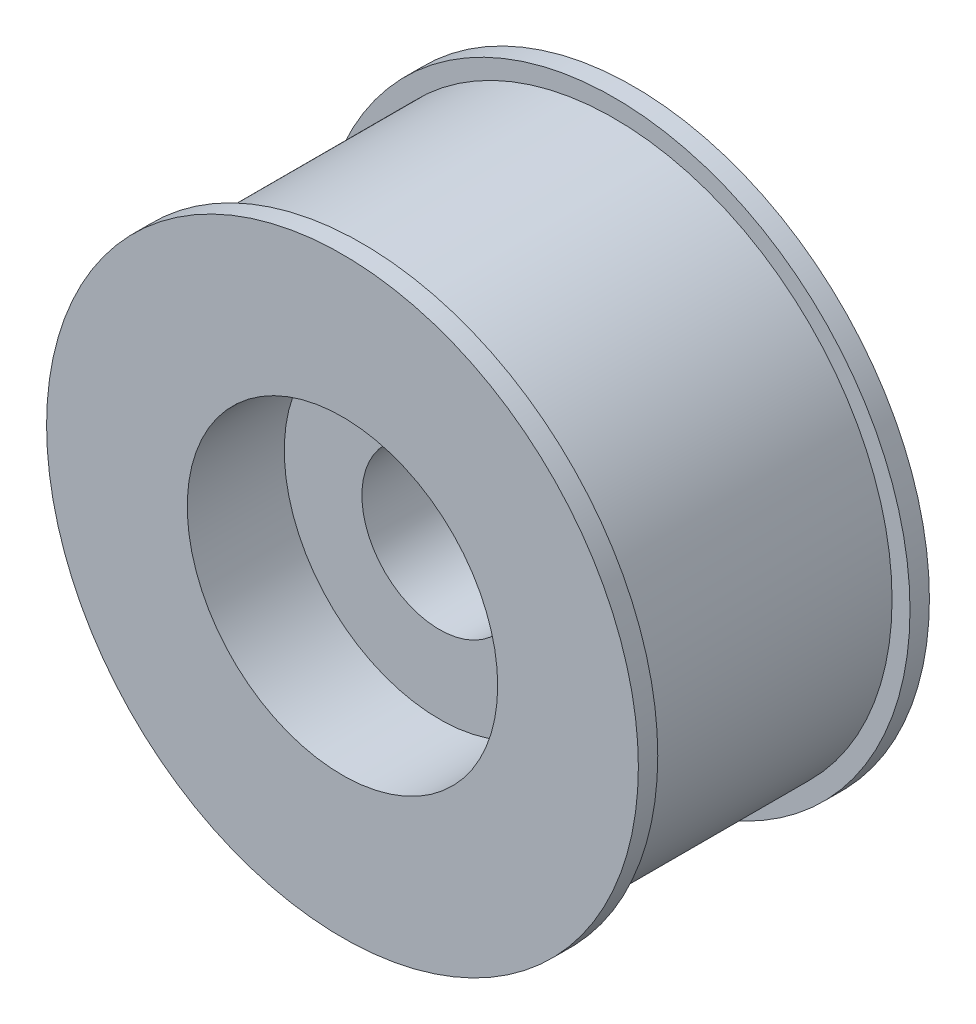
ISO-10303-21;
HEADER;
FILE_DESCRIPTION(('STEP AP214'),'2;1');
FILE_NAME('part.step','',(''),(''),'','','');
FILE_SCHEMA(('AUTOMOTIVE_DESIGN { 1 0 10303 214 1 1 1 1 }'));
ENDSEC;
DATA;
#1=APPLICATION_CONTEXT('core data for automotive mechanical design processes');
#2=APPLICATION_PROTOCOL_DEFINITION('international standard','automotive_design',2000,#1);
#3=PRODUCT_CONTEXT('',#1,'mechanical');
#4=PRODUCT('Part','Part','',(#3));
#5=PRODUCT_RELATED_PRODUCT_CATEGORY('part','',(#4));
#6=PRODUCT_DEFINITION_FORMATION('','',#4);
#7=PRODUCT_DEFINITION_CONTEXT('part definition',#1,'design');
#8=PRODUCT_DEFINITION('design','',#6,#7);
#9=PRODUCT_DEFINITION_SHAPE('','',#8);
#10=(LENGTH_UNIT() NAMED_UNIT(*) SI_UNIT(.MILLI.,.METRE.));
#11=(NAMED_UNIT(*) PLANE_ANGLE_UNIT() SI_UNIT($,.RADIAN.));
#12=(NAMED_UNIT(*) SI_UNIT($,.STERADIAN.) SOLID_ANGLE_UNIT());
#13=UNCERTAINTY_MEASURE_WITH_UNIT(LENGTH_MEASURE(1.E-05),#10,'distance_accuracy_value','');
#14=(GEOMETRIC_REPRESENTATION_CONTEXT(3) GLOBAL_UNCERTAINTY_ASSIGNED_CONTEXT((#13)) GLOBAL_UNIT_ASSIGNED_CONTEXT((#10,
#11,#12)) REPRESENTATION_CONTEXT('',''));
#15=CARTESIAN_POINT('',(0.,0.,0.));
#16=DIRECTION('',(0.,0.,1.));
#17=DIRECTION('',(1.,0.,0.));
#18=AXIS2_PLACEMENT_3D('',#15,#16,#17);
#19=CARTESIAN_POINT('',(0.,0.,0.));
#20=DIRECTION('',(0.,0.,-1.));
#21=DIRECTION('',(-1.,0.,0.));
#22=AXIS2_PLACEMENT_3D('',#19,#20,#21);
#23=PLANE('',#22);
#24=CARTESIAN_POINT('',(0.,0.,0.));
#25=DIRECTION('',(0.,0.,1.));
#26=DIRECTION('',(1.,0.,0.));
#27=AXIS2_PLACEMENT_3D('',#24,#25,#26);
#28=CIRCLE('',#27,16.);
#29=CARTESIAN_POINT('',(16.,0.,0.));
#30=VERTEX_POINT('',#29);
#31=EDGE_CURVE('E84',#30,#30,#28,.T.);
#32=ORIENTED_EDGE('',*,*,#31,.F.);
#33=EDGE_LOOP('',(#32));
#34=FACE_BOUND('',#33,.T.);
#35=CARTESIAN_POINT('',(0.,0.,0.));
#36=DIRECTION('',(0.,0.,1.));
#37=DIRECTION('',(1.,0.,0.));
#38=AXIS2_PLACEMENT_3D('',#35,#36,#37);
#39=CIRCLE('',#38,30.5);
#40=CARTESIAN_POINT('',(30.5,0.,0.));
#41=VERTEX_POINT('',#40);
#42=EDGE_CURVE('E10',#41,#41,#39,.T.);
#43=ORIENTED_EDGE('',*,*,#42,.T.);
#44=EDGE_LOOP('',(#43));
#45=FACE_BOUND('',#44,.T.);
#46=ADVANCED_FACE('F36',(#34,#45),#23,.F.);
#47=CARTESIAN_POINT('',(0.,0.,18.1621621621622));
#48=DIRECTION('',(0.,0.,1.));
#49=DIRECTION('',(1.,0.,0.));
#50=AXIS2_PLACEMENT_3D('',#47,#48,#49);
#51=CYLINDRICAL_SURFACE('',#50,30.5);
#52=ORIENTED_EDGE('',*,*,#42,.F.);
#53=EDGE_LOOP('',(#52));
#54=FACE_BOUND('',#53,.T.);
#55=CARTESIAN_POINT('',(0.,0.,-2.));
#56=DIRECTION('',(0.,0.,1.));
#57=DIRECTION('',(1.,0.,0.));
#58=AXIS2_PLACEMENT_3D('',#55,#56,#57);
#59=CIRCLE('',#58,30.5);
#60=CARTESIAN_POINT('',(30.5,0.,-2.));
#61=VERTEX_POINT('',#60);
#62=EDGE_CURVE('E44',#61,#61,#59,.T.);
#63=ORIENTED_EDGE('',*,*,#62,.T.);
#64=EDGE_LOOP('',(#63));
#65=FACE_BOUND('',#64,.T.);
#66=ADVANCED_FACE('F134',(#54,#65),#51,.T.);
#67=CARTESIAN_POINT('',(0.,30.5,-2.));
#68=DIRECTION('',(0.,0.,1.));
#69=DIRECTION('',(1.,0.,0.));
#70=AXIS2_PLACEMENT_3D('',#67,#68,#69);
#71=PLANE('',#70);
#72=ORIENTED_EDGE('',*,*,#62,.F.);
#73=EDGE_LOOP('',(#72));
#74=FACE_BOUND('',#73,.T.);
#75=CARTESIAN_POINT('',(0.,0.,-2.));
#76=DIRECTION('',(0.,0.,1.));
#77=DIRECTION('',(1.,0.,0.));
#78=AXIS2_PLACEMENT_3D('',#75,#76,#77);
#79=CIRCLE('',#78,28.65);
#80=CARTESIAN_POINT('',(28.65,0.,-2.));
#81=VERTEX_POINT('',#80);
#82=EDGE_CURVE('E49',#81,#81,#79,.T.);
#83=ORIENTED_EDGE('',*,*,#82,.T.);
#84=EDGE_LOOP('',(#83));
#85=FACE_BOUND('',#84,.T.);
#86=ADVANCED_FACE('F139',(#74,#85),#71,.F.);
#87=CARTESIAN_POINT('',(0.,0.,18.1621621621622));
#88=DIRECTION('',(0.,0.,1.));
#89=DIRECTION('',(1.,0.,0.));
#90=AXIS2_PLACEMENT_3D('',#87,#88,#89);
#91=CYLINDRICAL_SURFACE('',#90,28.65);
#92=ORIENTED_EDGE('',*,*,#82,.F.);
#93=EDGE_LOOP('',(#92));
#94=FACE_BOUND('',#93,.T.);
#95=CARTESIAN_POINT('',(0.,0.,-28.));
#96=DIRECTION('',(0.,0.,1.));
#97=DIRECTION('',(1.,0.,0.));
#98=AXIS2_PLACEMENT_3D('',#95,#96,#97);
#99=CIRCLE('',#98,28.65);
#100=CARTESIAN_POINT('',(28.65,0.,-28.));
#101=VERTEX_POINT('',#100);
#102=EDGE_CURVE('E55',#101,#101,#99,.T.);
#103=ORIENTED_EDGE('',*,*,#102,.T.);
#104=EDGE_LOOP('',(#103));
#105=FACE_BOUND('',#104,.T.);
#106=ADVANCED_FACE('F215',(#94,#105),#91,.T.);
#107=CARTESIAN_POINT('',(0.,28.65,-28.));
#108=DIRECTION('',(0.,0.,-1.));
#109=DIRECTION('',(-1.,0.,0.));
#110=AXIS2_PLACEMENT_3D('',#107,#108,#109);
#111=PLANE('',#110);
#112=ORIENTED_EDGE('',*,*,#102,.F.);
#113=EDGE_LOOP('',(#112));
#114=FACE_BOUND('',#113,.T.);
#115=CARTESIAN_POINT('',(0.,0.,-28.));
#116=DIRECTION('',(0.,0.,1.));
#117=DIRECTION('',(1.,0.,0.));
#118=AXIS2_PLACEMENT_3D('',#115,#116,#117);
#119=CIRCLE('',#118,30.5);
#120=CARTESIAN_POINT('',(30.5,0.,-28.));
#121=VERTEX_POINT('',#120);
#122=EDGE_CURVE('E59',#121,#121,#119,.T.);
#123=ORIENTED_EDGE('',*,*,#122,.T.);
#124=EDGE_LOOP('',(#123));
#125=FACE_BOUND('',#124,.T.);
#126=ADVANCED_FACE('F205',(#114,#125),#111,.F.);
#127=CARTESIAN_POINT('',(0.,0.,18.1621621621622));
#128=DIRECTION('',(0.,0.,1.));
#129=DIRECTION('',(1.,0.,0.));
#130=AXIS2_PLACEMENT_3D('',#127,#128,#129);
#131=CYLINDRICAL_SURFACE('',#130,30.5);
#132=ORIENTED_EDGE('',*,*,#122,.F.);
#133=EDGE_LOOP('',(#132));
#134=FACE_BOUND('',#133,.T.);
#135=CARTESIAN_POINT('',(0.,0.,-30.));
#136=DIRECTION('',(0.,0.,1.));
#137=DIRECTION('',(1.,0.,0.));
#138=AXIS2_PLACEMENT_3D('',#135,#136,#137);
#139=CIRCLE('',#138,30.5);
#140=CARTESIAN_POINT('',(30.5,0.,-30.));
#141=VERTEX_POINT('',#140);
#142=EDGE_CURVE('E63',#141,#141,#139,.T.);
#143=ORIENTED_EDGE('',*,*,#142,.T.);
#144=EDGE_LOOP('',(#143));
#145=FACE_BOUND('',#144,.T.);
#146=ADVANCED_FACE('F129',(#134,#145),#131,.T.);
#147=CARTESIAN_POINT('',(0.,30.5,-30.));
#148=DIRECTION('',(0.,0.,1.));
#149=DIRECTION('',(1.,0.,0.));
#150=AXIS2_PLACEMENT_3D('',#147,#148,#149);
#151=PLANE('',#150);
#152=ORIENTED_EDGE('',*,*,#142,.F.);
#153=EDGE_LOOP('',(#152));
#154=FACE_BOUND('',#153,.T.);
#155=CARTESIAN_POINT('',(0.,0.,-30.));
#156=DIRECTION('',(0.,0.,1.));
#157=DIRECTION('',(1.,0.,0.));
#158=AXIS2_PLACEMENT_3D('',#155,#156,#157);
#159=CIRCLE('',#158,19.);
#160=CARTESIAN_POINT('',(19.,0.,-30.));
#161=VERTEX_POINT('',#160);
#162=EDGE_CURVE('E67',#161,#161,#159,.T.);
#163=ORIENTED_EDGE('',*,*,#162,.T.);
#164=EDGE_LOOP('',(#163));
#165=FACE_BOUND('',#164,.T.);
#166=ADVANCED_FACE('F123',(#154,#165),#151,.F.);
#167=CARTESIAN_POINT('',(0.,0.,18.1621621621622));
#168=DIRECTION('',(0.,0.,1.));
#169=DIRECTION('',(1.,0.,0.));
#170=AXIS2_PLACEMENT_3D('',#167,#168,#169);
#171=CYLINDRICAL_SURFACE('',#170,19.);
#172=ORIENTED_EDGE('',*,*,#162,.F.);
#173=EDGE_LOOP('',(#172));
#174=FACE_BOUND('',#173,.T.);
#175=CARTESIAN_POINT('',(0.,0.,-36.));
#176=DIRECTION('',(0.,0.,1.));
#177=DIRECTION('',(1.,0.,0.));
#178=AXIS2_PLACEMENT_3D('',#175,#176,#177);
#179=CIRCLE('',#178,19.);
#180=CARTESIAN_POINT('',(19.,0.,-36.));
#181=VERTEX_POINT('',#180);
#182=EDGE_CURVE('E71',#181,#181,#179,.T.);
#183=ORIENTED_EDGE('',*,*,#182,.T.);
#184=EDGE_LOOP('',(#183));
#185=FACE_BOUND('',#184,.T.);
#186=ADVANCED_FACE('F118',(#174,#185),#171,.T.);
#187=CARTESIAN_POINT('',(0.,19.,-36.));
#188=DIRECTION('',(0.,0.,1.));
#189=DIRECTION('',(1.,0.,0.));
#190=AXIS2_PLACEMENT_3D('',#187,#188,#189);
#191=PLANE('',#190);
#192=CARTESIAN_POINT('',(0.,0.,-36.));
#193=DIRECTION('',(0.,0.,-1.));
#194=DIRECTION('',(-1.,0.,0.));
#195=AXIS2_PLACEMENT_3D('',#192,#193,#194);
#196=CIRCLE('',#195,16.);
#197=CARTESIAN_POINT('',(-16.,0.,-36.));
#198=VERTEX_POINT('',#197);
#199=EDGE_CURVE('E76',#198,#198,#196,.T.);
#200=ORIENTED_EDGE('',*,*,#199,.F.);
#201=EDGE_LOOP('',(#200));
#202=FACE_BOUND('',#201,.T.);
#203=ORIENTED_EDGE('',*,*,#182,.F.);
#204=EDGE_LOOP('',(#203));
#205=FACE_BOUND('',#204,.T.);
#206=ADVANCED_FACE('F112',(#202,#205),#191,.F.);
#207=CARTESIAN_POINT('',(0.,0.,-26.));
#208=DIRECTION('',(0.,0.,-1.));
#209=DIRECTION('',(-1.,0.,0.));
#210=AXIS2_PLACEMENT_3D('',#207,#208,#209);
#211=CYLINDRICAL_SURFACE('',#210,16.);
#212=CARTESIAN_POINT('',(0.,0.,-26.));
#213=DIRECTION('',(0.,0.,-1.));
#214=DIRECTION('',(-1.,0.,0.));
#215=AXIS2_PLACEMENT_3D('',#212,#213,#214);
#216=CIRCLE('',#215,16.);
#217=CARTESIAN_POINT('',(-16.,0.,-26.));
#218=VERTEX_POINT('',#217);
#219=EDGE_CURVE('E75',#218,#218,#216,.T.);
#220=ORIENTED_EDGE('',*,*,#219,.F.);
#221=EDGE_LOOP('',(#220));
#222=FACE_BOUND('',#221,.T.);
#223=ORIENTED_EDGE('',*,*,#199,.T.);
#224=EDGE_LOOP('',(#223));
#225=FACE_BOUND('',#224,.T.);
#226=ADVANCED_FACE('F106',(#222,#225),#211,.F.);
#227=CARTESIAN_POINT('',(0.,0.,-26.));
#228=DIRECTION('',(0.,0.,-1.));
#229=DIRECTION('',(-1.,0.,0.));
#230=AXIS2_PLACEMENT_3D('',#227,#228,#229);
#231=PLANE('',#230);
#232=CARTESIAN_POINT('',(0.,0.,-26.));
#233=DIRECTION('',(0.,0.,-1.));
#234=DIRECTION('',(-1.,0.,0.));
#235=AXIS2_PLACEMENT_3D('',#232,#233,#234);
#236=CIRCLE('',#235,8.);
#237=CARTESIAN_POINT('',(-8.,0.,-26.));
#238=VERTEX_POINT('',#237);
#239=EDGE_CURVE('E39',#238,#238,#236,.T.);
#240=ORIENTED_EDGE('',*,*,#239,.F.);
#241=EDGE_LOOP('',(#240));
#242=FACE_BOUND('',#241,.T.);
#243=ORIENTED_EDGE('',*,*,#219,.T.);
#244=EDGE_LOOP('',(#243));
#245=FACE_BOUND('',#244,.T.);
#246=ADVANCED_FACE('F102',(#242,#245),#231,.T.);
#247=CARTESIAN_POINT('',(0.,0.,-10.));
#248=DIRECTION('',(0.,0.,1.));
#249=DIRECTION('',(1.,0.,0.));
#250=AXIS2_PLACEMENT_3D('',#247,#248,#249);
#251=CYLINDRICAL_SURFACE('',#250,16.);
#252=CARTESIAN_POINT('',(0.,0.,-10.));
#253=DIRECTION('',(0.,0.,1.));
#254=DIRECTION('',(1.,0.,0.));
#255=AXIS2_PLACEMENT_3D('',#252,#253,#254);
#256=CIRCLE('',#255,16.);
#257=CARTESIAN_POINT('',(16.,0.,-10.));
#258=VERTEX_POINT('',#257);
#259=EDGE_CURVE('E80',#258,#258,#256,.T.);
#260=ORIENTED_EDGE('',*,*,#259,.F.);
#261=EDGE_LOOP('',(#260));
#262=FACE_BOUND('',#261,.T.);
#263=ORIENTED_EDGE('',*,*,#31,.T.);
#264=EDGE_LOOP('',(#263));
#265=FACE_BOUND('',#264,.T.);
#266=ADVANCED_FACE('F105',(#262,#265),#251,.F.);
#267=CARTESIAN_POINT('',(0.,0.,-10.));
#268=DIRECTION('',(0.,0.,1.));
#269=DIRECTION('',(1.,0.,0.));
#270=AXIS2_PLACEMENT_3D('',#267,#268,#269);
#271=PLANE('',#270);
#272=CARTESIAN_POINT('',(0.,0.,-10.));
#273=DIRECTION('',(0.,0.,1.));
#274=DIRECTION('',(1.,0.,0.));
#275=AXIS2_PLACEMENT_3D('',#272,#273,#274);
#276=CIRCLE('',#275,8.);
#277=CARTESIAN_POINT('',(8.,0.,-10.));
#278=VERTEX_POINT('',#277);
#279=EDGE_CURVE('E91',#278,#278,#276,.T.);
#280=ORIENTED_EDGE('',*,*,#279,.F.);
#281=EDGE_LOOP('',(#280));
#282=FACE_BOUND('',#281,.T.);
#283=ORIENTED_EDGE('',*,*,#259,.T.);
#284=EDGE_LOOP('',(#283));
#285=FACE_BOUND('',#284,.T.);
#286=ADVANCED_FACE('F144',(#282,#285),#271,.T.);
#287=CARTESIAN_POINT('',(0.,0.,-30.));
#288=DIRECTION('',(0.,0.,1.));
#289=DIRECTION('',(1.,0.,0.));
#290=AXIS2_PLACEMENT_3D('',#287,#288,#289);
#291=CYLINDRICAL_SURFACE('',#290,8.);
#292=ORIENTED_EDGE('',*,*,#239,.T.);
#293=EDGE_LOOP('',(#292));
#294=FACE_BOUND('',#293,.T.);
#295=ORIENTED_EDGE('',*,*,#279,.T.);
#296=EDGE_LOOP('',(#295));
#297=FACE_BOUND('',#296,.T.);
#298=ADVANCED_FACE('F100',(#294,#297),#291,.F.);
#299=CLOSED_SHELL('',(#46,#66,#86,#106,#126,#146,#166,#186,#206,#226,#246,#266,#286,#298));
#300=MANIFOLD_SOLID_BREP('B2',#299);
#301=ADVANCED_BREP_SHAPE_REPRESENTATION('',(#18,#300),#14);
#302=SHAPE_DEFINITION_REPRESENTATION(#9,#301);
ENDSEC;
END-ISO-10303-21;
